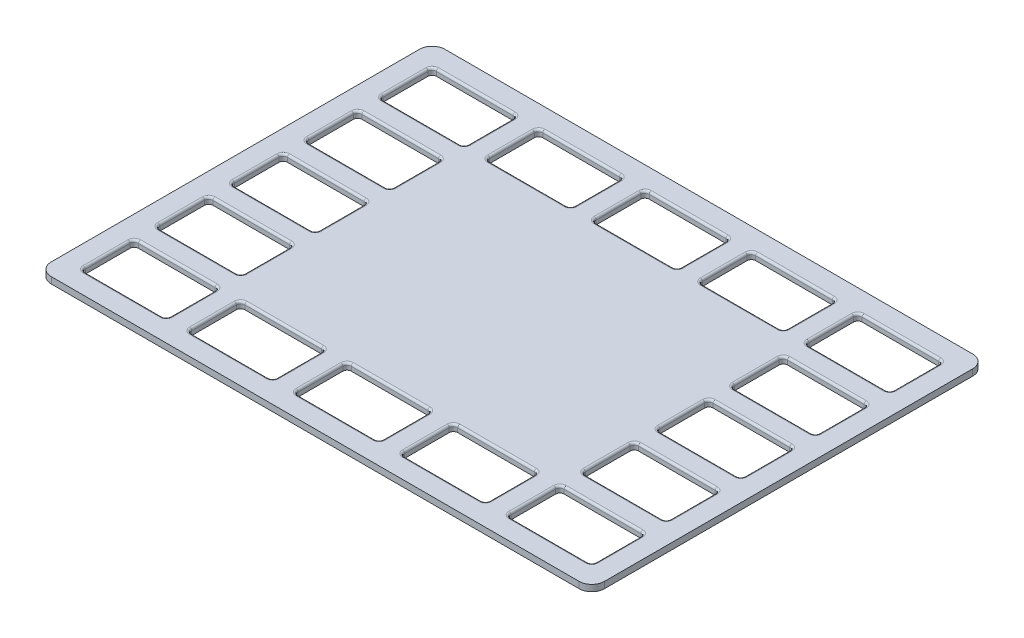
from build123d import *

# Parameters (mm, degrees)
SKETCH1_W              = 260
SKETCH1_H              = 185
EXTRUDE1_DEPTH         = 3
FILLET3_R              = 6
SKETCH2_W              = 40
SKETCH2_H              = 25
CUT_EXTRUDE1_DEPTH     = 320.11439955
FILLET1_R              = 2
FILLET2_R              = 1
LPATTERN1_COUNT        = 5
LPATTERN1_PITCH        = 50
LPATTERN1_COUNT_DIR2   = 5
LPATTERN1_PITCH_DIR2   = 35
FILLET1_OF_LPATTERN1_R = 2
FILLET2_OF_LPATTERN1_R = 1


with BuildPart() as part:
    # Sketch1 → Extrude1 (new body)
    with BuildSketch(Plane(origin=(0, 0, 0), x_dir=(1, 0, 0), z_dir=(0, 1, 0))):
        with Locations((130, 92.5)):
            Rectangle(SKETCH1_W, SKETCH1_H)
    extrude(amount=EXTRUDE1_DEPTH)

    # Fillet3
    fillet3_edges = [part.edges().sort_by_distance(p)[0] for p in [
        (0, 1.5, -185),
        (260, 1.5, -185),
        (260, 1.5, 0),
        (0, 1.5, 0),
    ]]
    fillet(fillet3_edges, radius=FILLET3_R)

    # Sketch2 → Cut-Extrude1 (cut, through all)
    with BuildSketch(Plane(origin=(0, 3, 0), x_dir=(-1, 0, 0), z_dir=(0, 1, 0))):
        with Locations((-30, -22.5)):
            Rectangle(SKETCH2_W, SKETCH2_H)
    cut_extrude1 = extrude(amount=-CUT_EXTRUDE1_DEPTH, mode=Mode.SUBTRACT)

    # Fillet1
    fillet1_edges = [part.edges().sort_by_distance(p)[0] for p in [
        (10, 1.5, -10),
        (10, 1.5, -35),
        (50, 1.5, -35),
        (50, 1.5, -10),
    ]]
    fillet(fillet1_edges, radius=FILLET1_R)

    # Fillet2
    fillet2_edges = [part.edges().sort_by_distance(p)[0] for p in [
        (30, 3, -35),
        (50, 3, -22.5),
        (30, 3, -10),
        (10, 3, -22.5),
        (49.414213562, 3, -34.414213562),
        (49.414213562, 3, -10.585786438),
        (10.585786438, 3, -10.585786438),
        (10.585786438, 3, -34.414213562),
    ]]
    fillet(fillet2_edges, radius=FILLET2_R)

    # LPattern1: Cut-Extrude1 5 × 5, 9 skipped
    with Locations(*[(i * LPATTERN1_PITCH, 0, -j * LPATTERN1_PITCH_DIR2) for i in range(LPATTERN1_COUNT) for j in range(LPATTERN1_COUNT_DIR2) if (i, j) not in ((0, 0), (1, 1), (1, 2), (1, 3), (2, 1), (2, 2), (2, 3), (3, 1), (3, 2), (3, 3))]):
        add(cut_extrude1, mode=Mode.SUBTRACT)

    # Fillet1 of LPattern1
    fillet1_of_lpattern1_edges = [part.edges().sort_by_distance(p)[0] for p in [
        (10, 1.5, -45),
        (10, 1.5, -70),
        (50, 1.5, -70),
        (50, 1.5, -45),
        (10, 1.5, -80),
        (10, 1.5, -105),
        (50, 1.5, -105),
        (50, 1.5, -80),
        (10, 1.5, -115),
        (10, 1.5, -140),
        (50, 1.5, -140),
        (50, 1.5, -115),
        (10, 1.5, -150),
        (10, 1.5, -175),
        (50, 1.5, -175),
        (50, 1.5, -150),
        (60, 1.5, -10),
        (60, 1.5, -35),
        (100, 1.5, -35),
        (100, 1.5, -10),
        (60, 1.5, -150),
        (60, 1.5, -175),
        (100, 1.5, -175),
        (100, 1.5, -150),
        (110, 1.5, -10),
        (110, 1.5, -35),
        (150, 1.5, -35),
        (150, 1.5, -10),
        (110, 1.5, -150),
        (110, 1.5, -175),
        (150, 1.5, -175),
        (150, 1.5, -150),
        (160, 1.5, -10),
        (160, 1.5, -35),
        (200, 1.5, -35),
        (200, 1.5, -10),
        (160, 1.5, -150),
        (160, 1.5, -175),
        (200, 1.5, -175),
        (200, 1.5, -150),
        (210, 1.5, -10),
        (210, 1.5, -35),
        (250, 1.5, -35),
        (250, 1.5, -10),
        (210, 1.5, -45),
        (210, 1.5, -70),
        (250, 1.5, -70),
        (250, 1.5, -45),
        (210, 1.5, -80),
        (210, 1.5, -105),
        (250, 1.5, -105),
        (250, 1.5, -80),
        (210, 1.5, -115),
        (210, 1.5, -140),
        (250, 1.5, -140),
        (250, 1.5, -115),
        (210, 1.5, -150),
        (210, 1.5, -175),
        (250, 1.5, -175),
        (250, 1.5, -150),
    ]]
    fillet(fillet1_of_lpattern1_edges, radius=FILLET1_OF_LPATTERN1_R)

    # Fillet2 of LPattern1
    fillet2_of_lpattern1_edges = [part.edges().sort_by_distance(p)[0] for p in [
        (30, 3, -70),
        (50, 3, -57.5),
        (30, 3, -45),
        (10, 3, -57.5),
        (49.414213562, 3, -69.414213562),
        (49.414213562, 3, -45.585786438),
        (10.585786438, 3, -45.585786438),
        (10.585786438, 3, -69.414213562),
        (30, 3, -105),
        (50, 3, -92.5),
        (30, 3, -80),
        (10, 3, -92.5),
        (49.414213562, 3, -104.414213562),
        (49.414213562, 3, -80.585786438),
        (10.585786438, 3, -80.585786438),
        (10.585786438, 3, -104.414213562),
        (30, 3, -140),
        (50, 3, -127.5),
        (30, 3, -115),
        (10, 3, -127.5),
        (49.414213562, 3, -139.414213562),
        (49.414213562, 3, -115.585786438),
        (10.585786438, 3, -115.585786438),
        (10.585786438, 3, -139.414213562),
        (30, 3, -175),
        (50, 3, -162.5),
        (30, 3, -150),
        (10, 3, -162.5),
        (49.414213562, 3, -174.414213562),
        (49.414213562, 3, -150.585786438),
        (10.585786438, 3, -150.585786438),
        (10.585786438, 3, -174.414213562),
        (80, 3, -35),
        (100, 3, -22.5),
        (80, 3, -10),
        (60, 3, -22.5),
        (99.414213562, 3, -34.414213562),
        (99.414213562, 3, -10.585786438),
        (60.585786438, 3, -10.585786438),
        (60.585786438, 3, -34.414213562),
        (80, 3, -175),
        (100, 3, -162.5),
        (80, 3, -150),
        (60, 3, -162.5),
        (99.414213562, 3, -174.414213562),
        (99.414213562, 3, -150.585786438),
        (60.585786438, 3, -150.585786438),
        (60.585786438, 3, -174.414213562),
        (130, 3, -35),
        (150, 3, -22.5),
        (130, 3, -10),
        (110, 3, -22.5),
        (149.414213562, 3, -34.414213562),
        (149.414213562, 3, -10.585786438),
        (110.585786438, 3, -10.585786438),
        (110.585786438, 3, -34.414213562),
        (130, 3, -175),
        (150, 3, -162.5),
        (130, 3, -150),
        (110, 3, -162.5),
        (149.414213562, 3, -174.414213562),
        (149.414213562, 3, -150.585786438),
        (110.585786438, 3, -150.585786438),
        (110.585786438, 3, -174.414213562),
        (180, 3, -35),
        (200, 3, -22.5),
        (180, 3, -10),
        (160, 3, -22.5),
        (199.414213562, 3, -34.414213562),
        (199.414213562, 3, -10.585786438),
        (160.585786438, 3, -10.585786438),
        (160.585786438, 3, -34.414213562),
        (180, 3, -175),
        (200, 3, -162.5),
        (180, 3, -150),
        (160, 3, -162.5),
        (199.414213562, 3, -174.414213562),
        (199.414213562, 3, -150.585786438),
        (160.585786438, 3, -150.585786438),
        (160.585786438, 3, -174.414213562),
        (230, 3, -35),
        (250, 3, -22.5),
        (230, 3, -10),
        (210, 3, -22.5),
        (249.414213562, 3, -34.414213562),
        (249.414213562, 3, -10.585786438),
        (210.585786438, 3, -10.585786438),
        (210.585786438, 3, -34.414213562),
        (230, 3, -70),
        (250, 3, -57.5),
        (230, 3, -45),
        (210, 3, -57.5),
        (249.414213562, 3, -69.414213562),
        (249.414213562, 3, -45.585786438),
        (210.585786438, 3, -45.585786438),
        (210.585786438, 3, -69.414213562),
        (230, 3, -105),
        (250, 3, -92.5),
        (230, 3, -80),
        (210, 3, -92.5),
        (249.414213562, 3, -104.414213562),
        (249.414213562, 3, -80.585786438),
        (210.585786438, 3, -80.585786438),
        (210.585786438, 3, -104.414213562),
        (230, 3, -140),
        (250, 3, -127.5),
        (230, 3, -115),
        (210, 3, -127.5),
        (249.414213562, 3, -139.414213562),
        (249.414213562, 3, -115.585786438),
        (210.585786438, 3, -115.585786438),
        (210.585786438, 3, -139.414213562),
        (230, 3, -175),
        (250, 3, -162.5),
        (230, 3, -150),
        (210, 3, -162.5),
        (249.414213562, 3, -174.414213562),
        (249.414213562, 3, -150.585786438),
        (210.585786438, 3, -150.585786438),
        (210.585786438, 3, -174.414213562),
    ]]
    fillet(fillet2_of_lpattern1_edges, radius=FILLET2_OF_LPATTERN1_R)


solid = part.part
